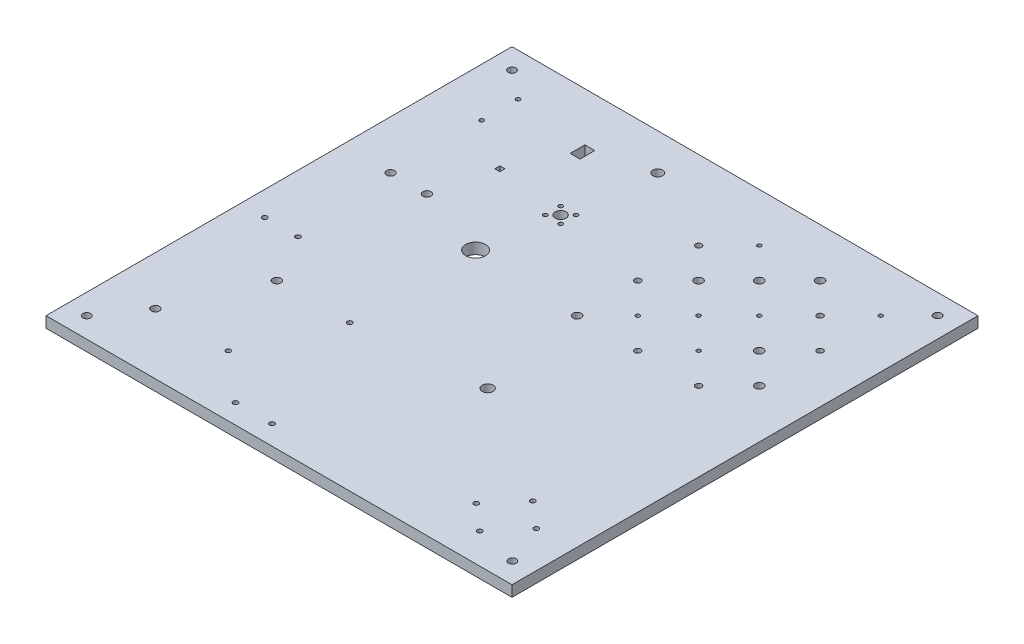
from build123d import *

# Parameters (mm, degrees)
SKETCH2_W                    = 383.54
SKETCH2_H                    = 383.54
BOSS_EXTRUDE2_DEPTH          = 8.9916
TAP_DRILL_FOR_M4X0_7_TAP1_D  = 3.3
TAP_DRILL_FOR_M6X1_0_TAP1_D  = 5
TAP_DRILL_FOR_M8X1_25_TAP1_D = 6.8
F_1_4_0_2500_DOWEL_HOLE1_D   = 6.35
F_4_0MM_DOWEL_HOLE1_D        = 4
F_4_0MM_DOWEL_HOLE1_DEPTH    = 8.99
F_4_0MM_DOWEL_HOLE1_TIP      = 1.201721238
M6_CLEARANCE_HOLE2_D         = 6.6
M6_CLEARANCE_HOLE2_DEPTH     = 8.99
M6_CLEARANCE_HOLE2_TIP       = 1.982840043
M8_CLEARANCE_HOLE1_D         = 9
M8_CLEARANCE_HOLE1_DEPTH     = 8.99
M8_CLEARANCE_HOLE1_TIP       = 2.703872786
M3_CLEARANCE_HOLE1_D         = 3.4
M3_CLEARANCE_HOLE1_DEPTH     = 8.99
M3_CLEARANCE_HOLE1_TIP       = 1.021463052
SKETCH19_R                   = 8.1
SKETCH19_R_2                 = 4.06
SKETCH19_R_3                 = 4.5
SKETCH19_W                   = 8.12
SKETCH19_H                   = 12.14
SKETCH19_W_2                 = 4.12
SKETCH19_H_2                 = 4.12
CUT_EXTRUDE1_DEPTH           = 272.352749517


with BuildPart() as part:
    # Sketch2 → Boss-Extrude2 (new body)
    with BuildSketch(Plane(origin=(0, 0, 0), x_dir=(1, 0, 0), z_dir=(0, 1, 0))):
        Rectangle(SKETCH2_W, SKETCH2_H)
    extrude(amount=BOSS_EXTRUDE2_DEPTH)

    # Tap Drill for M4x0.7 Tap1 (through all)
    with Locations(Plane(origin=(0, 8.9916, 0), x_dir=(1, 0, 0), z_dir=(0, 1, 0))):
        with Locations((51.77, 151.77), (151.77, 151.77), (101.77, 101.77), (51.77, 51.77), (76.77, 76.77), (101.77, 51.77)):
            Hole(TAP_DRILL_FOR_M4X0_7_TAP1_D / 2)

    # Tap Drill for M6x1.0 Tap1 (through all)
    with Locations(Plane(origin=(0, 8.9916, 0), x_dir=(1, 0, 0), z_dir=(0, 1, 0))):
        with Locations((126.77, 126.77), (26.77, 126.77), (151.77, 101.77), (126.77, 26.77), (76.77, 26.77), (26.77, 76.77), (176.187767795, 220.177696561)):
            Hole(TAP_DRILL_FOR_M6X1_0_TAP1_D / 2)

    # Tap Drill for M8x1.25 Tap1 (through all)
    with Locations(Plane(origin=(0, 8.9916, 0), x_dir=(1, 0, 0), z_dir=(0, 1, 0))):
        with Locations((151.77, 51.77), (126.77, 76.77), (76.77, 126.77), (101.77, 151.77), (26.77, 26.77), (51.77, 101.77)):
            Hole(TAP_DRILL_FOR_M8X1_25_TAP1_D / 2)

    # 1_4 _0.2500_ Dowel Hole1 (through all)
    with Locations(Plane(origin=(0, 8.9916, 0), x_dir=(1, 0, 0), z_dir=(0, 1, 0))):
        with Locations((-175, -175), (-175, 175), (175, 175.23), (175, -174.77)):
            Hole(F_1_4_0_2500_DOWEL_HOLE1_D / 2)

    # 4.0mm Dowel Hole1
    with Locations(Plane(origin=(0, 8.9916, 0), x_dir=(1, 0, 0), z_dir=(0, 1, 0))):
        with Locations((-51.77, -175.77), (-21.77, -175.77), (-91.77, -141.77), (-61.77, -71.77), (-171.77, -31.77), (-144.338, -31.77), (140.229340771, -166.77), (161.77, -141.77), (140.577784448, -123.47), (119.03712522, -148.47)):
            Hole(F_4_0MM_DOWEL_HOLE1_D / 2, depth=F_4_0MM_DOWEL_HOLE1_DEPTH)
            with Locations((0, 0, -(F_4_0MM_DOWEL_HOLE1_DEPTH + F_4_0MM_DOWEL_HOLE1_TIP / 2))):  # 118° drill point
                Cone(0, F_4_0MM_DOWEL_HOLE1_D / 2, F_4_0MM_DOWEL_HOLE1_TIP, mode=Mode.SUBTRACT)

    # M6 Clearance Hole2
    with Locations(Plane(origin=(0, 8.9916, 0), x_dir=(1, 0, 0), z_dir=(0, 1, 0))):
        with Locations((-151.77, -141.77), (-121.77, -71.77), (-151.77, 51.77), (-121.77, 51.77)):
            Hole(M6_CLEARANCE_HOLE2_D / 2, depth=M6_CLEARANCE_HOLE2_DEPTH)
            with Locations((0, 0, -(M6_CLEARANCE_HOLE2_DEPTH + M6_CLEARANCE_HOLE2_TIP / 2))):  # 118° drill point
                Cone(0, M6_CLEARANCE_HOLE2_D / 2, M6_CLEARANCE_HOLE2_TIP, mode=Mode.SUBTRACT)

    # M8 Clearance Hole1
    with Locations(Plane(origin=(0, 8.9916, 0), x_dir=(1, 0, 0), z_dir=(0, 1, 0))):
        with Locations((41.77, -61.77)):
            Hole(M8_CLEARANCE_HOLE1_D / 2, depth=M8_CLEARANCE_HOLE1_DEPTH)
            with Locations((0, 0, -(M8_CLEARANCE_HOLE1_DEPTH + M8_CLEARANCE_HOLE1_TIP / 2))):  # 118° drill point
                Cone(0, M8_CLEARANCE_HOLE1_D / 2, M8_CLEARANCE_HOLE1_TIP, mode=Mode.SUBTRACT)

    # M3 Clearance Hole1
    with Locations(Plane(origin=(0, 8.9916, 0), x_dir=(1, 0, 0), z_dir=(0, 1, 0))):
        with Locations((-151.77, 156.77), (-151.77, 126.77), (-58.09, 85.44), (-45.44, 85.44), (-45.44, 98.09), (-58.09, 98.09)):
            Hole(M3_CLEARANCE_HOLE1_D / 2, depth=M3_CLEARANCE_HOLE1_DEPTH)
            with Locations((0, 0, -(M3_CLEARANCE_HOLE1_DEPTH + M3_CLEARANCE_HOLE1_TIP / 2))):  # 118° drill point
                Cone(0, M3_CLEARANCE_HOLE1_D / 2, M3_CLEARANCE_HOLE1_TIP, mode=Mode.SUBTRACT)

    # Sketch19 → Cut-Extrude1 (cut, through all)
    with BuildSketch(Plane(origin=(0, 8.9916, 0), x_dir=(1, 0, 0), z_dir=(0, 1, 0))):
        with Locations(Location((-61.77, 31.77, 0), (0, 0, 270))):
            Circle(SKETCH19_R)
        with Locations(Location((-41.77, 161.77, 0), (0, 0, 270))):
            Circle(SKETCH19_R_2)
        with Locations(Location((-51.77, 91.77, 0), (0, 0, 270))):
            Circle(SKETCH19_R_3)
        with Locations((-87.71, 145.7)):
            Rectangle(SKETCH19_W, SKETCH19_H)
        with Locations((-109.71, 99.71)):
            Rectangle(SKETCH19_W_2, SKETCH19_H_2)
    extrude(amount=-CUT_EXTRUDE1_DEPTH, mode=Mode.SUBTRACT)


solid = part.part
